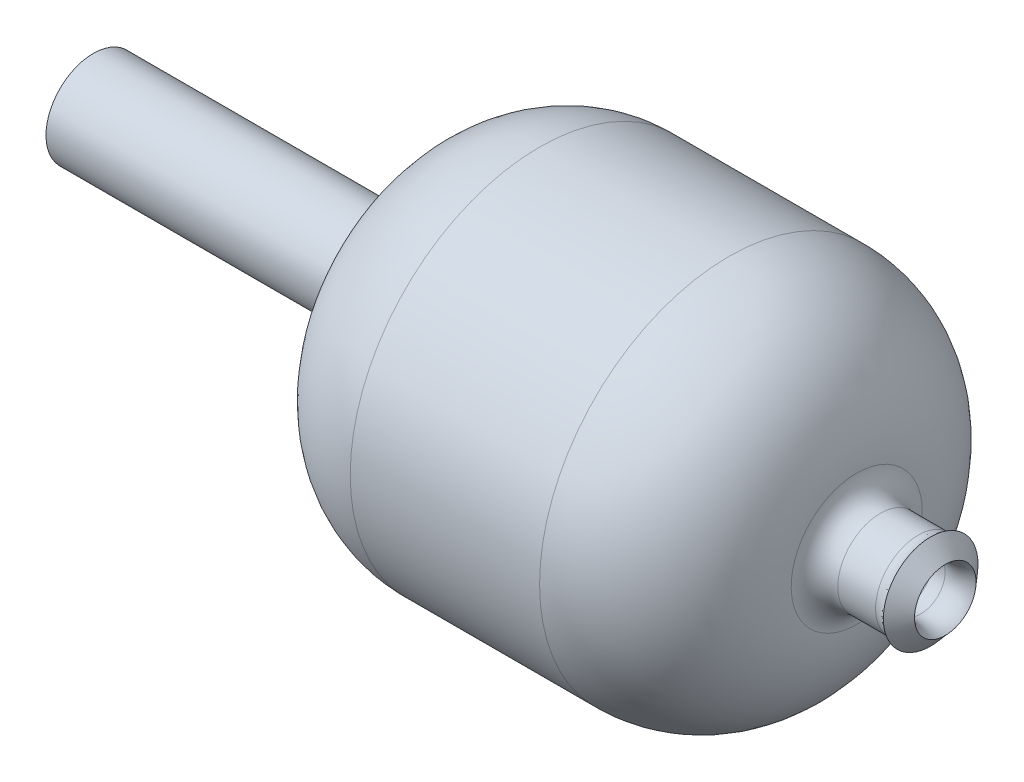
from build123d import *


with BuildPart() as part:
    # Sketch1 → Revolve1 (revolve)
    with BuildSketch(Plane.XY):
        with BuildLine():
            Line((-17.866068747, 19.5), (-37.866068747, 19.5))
            ThreePointArc((-37.866068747, 19.5), (-46.368936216, 15.967658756), (-49.865965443, 7.450207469))
            ThreePointArc((-49.865965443, 7.450207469), (-51.157481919, 4.304557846), (-54.297745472, 3))
            Line((-54.297745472, 3), (-85, 3))
            Line((-85, 3), (-85, 5))
            Line((-85, 5), (-54.297745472, 5))
            ThreePointArc((-54.297745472, 5), (-52.275145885, 5.784353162), (-51.310167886, 7.727272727))
            ThreePointArc((-51.310167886, 7.727272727), (-46.967766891, 16.470410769), (-37.866068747, 20))
            Line((-37.866068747, 20), (-17.866068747, 20))
            ThreePointArc((-17.866068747, 20), (-8.470466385, 16.193949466), (-4.372662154, 6.921875))
            ThreePointArc((-4.372662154, 6.921875), (-3.613809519, 5.204824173), (-1.873883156, 4.5))
            Line((-1.873883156, 4.5), (2.118082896, 4.5))
            ThreePointArc((2.118082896, 4.5), (2.825189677, 4.629171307), (3.440958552, 5))
            Line((3.440958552, 5), (4.984313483, 3.25))
            ThreePointArc((4.984313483, 3.25), (3.780516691, 2.603313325), (2.414777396, 2.557634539))
            ThreePointArc((2.414777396, 2.557634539), (1.698774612, 2.633963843), (0.980688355, 2.580688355))
            ThreePointArc((0.980688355, 2.580688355), (0, 2.5), (-0.980688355, 2.580688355))
            ThreePointArc((-0.980688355, 2.580688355), (-1.698774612, 2.633963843), (-2.414777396, 2.557634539))
            ThreePointArc((-2.414777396, 2.557634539), (-5.053893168, 3.313330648), (-5.973213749, 5.9))
            ThreePointArc((-5.973213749, 5.9), (-8.832796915, 15.399367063), (-17.866068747, 19.5))
        make_face()
    revolve(axis=Axis((0, 0, 0), (-1, 0, 0)))


solid = part.part
